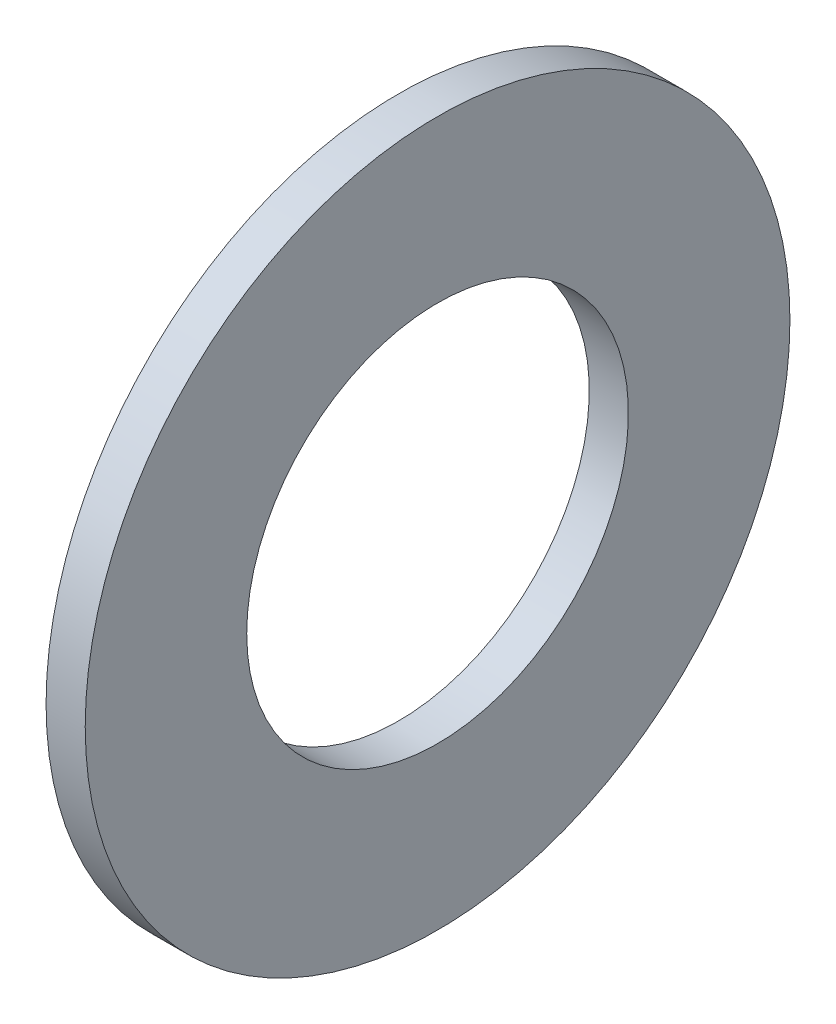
ISO-10303-21;
HEADER;
FILE_DESCRIPTION(('STEP AP214'),'2;1');
FILE_NAME('part.step','',(''),(''),'','','');
FILE_SCHEMA(('AUTOMOTIVE_DESIGN { 1 0 10303 214 1 1 1 1 }'));
ENDSEC;
DATA;
#1=APPLICATION_CONTEXT('core data for automotive mechanical design processes');
#2=APPLICATION_PROTOCOL_DEFINITION('international standard','automotive_design',2000,#1);
#3=PRODUCT_CONTEXT('',#1,'mechanical');
#4=PRODUCT('Part','Part','',(#3));
#5=PRODUCT_RELATED_PRODUCT_CATEGORY('part','',(#4));
#6=PRODUCT_DEFINITION_FORMATION('','',#4);
#7=PRODUCT_DEFINITION_CONTEXT('part definition',#1,'design');
#8=PRODUCT_DEFINITION('design','',#6,#7);
#9=PRODUCT_DEFINITION_SHAPE('','',#8);
#10=(LENGTH_UNIT() NAMED_UNIT(*) SI_UNIT(.MILLI.,.METRE.));
#11=(NAMED_UNIT(*) PLANE_ANGLE_UNIT() SI_UNIT($,.RADIAN.));
#12=(NAMED_UNIT(*) SI_UNIT($,.STERADIAN.) SOLID_ANGLE_UNIT());
#13=UNCERTAINTY_MEASURE_WITH_UNIT(LENGTH_MEASURE(1.E-05),#10,'distance_accuracy_value','');
#14=(GEOMETRIC_REPRESENTATION_CONTEXT(3) GLOBAL_UNCERTAINTY_ASSIGNED_CONTEXT((#13)) GLOBAL_UNIT_ASSIGNED_CONTEXT((#10,
#11,#12)) REPRESENTATION_CONTEXT('',''));
#15=CARTESIAN_POINT('',(0.,0.,0.));
#16=DIRECTION('',(0.,0.,1.));
#17=DIRECTION('',(1.,0.,0.));
#18=AXIS2_PLACEMENT_3D('',#15,#16,#17);
#19=CARTESIAN_POINT('',(-34.9249999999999,0.,0.));
#20=DIRECTION('',(-1.,0.,0.));
#21=DIRECTION('',(0.,0.,1.));
#22=AXIS2_PLACEMENT_3D('',#19,#20,#21);
#23=CYLINDRICAL_SURFACE('',#22,19.5);
#24=CARTESIAN_POINT('',(0.,0.,0.));
#25=DIRECTION('',(-1.,0.,0.));
#26=DIRECTION('',(0.,0.,1.));
#27=AXIS2_PLACEMENT_3D('',#24,#25,#26);
#28=CIRCLE('',#27,19.5);
#29=CARTESIAN_POINT('',(0.,0.,19.5));
#30=VERTEX_POINT('',#29);
#31=EDGE_CURVE('E10',#30,#30,#28,.T.);
#32=ORIENTED_EDGE('',*,*,#31,.F.);
#33=EDGE_LOOP('',(#32));
#34=FACE_BOUND('',#33,.T.);
#35=CARTESIAN_POINT('',(-4.,0.,0.));
#36=DIRECTION('',(-1.,0.,0.));
#37=DIRECTION('',(0.,0.,1.));
#38=AXIS2_PLACEMENT_3D('',#35,#36,#37);
#39=CIRCLE('',#38,19.5);
#40=CARTESIAN_POINT('',(-4.,0.,19.5));
#41=VERTEX_POINT('',#40);
#42=EDGE_CURVE('E45',#41,#41,#39,.T.);
#43=ORIENTED_EDGE('',*,*,#42,.T.);
#44=EDGE_LOOP('',(#43));
#45=FACE_BOUND('',#44,.T.);
#46=ADVANCED_FACE('F31',(#34,#45),#23,.F.);
#47=CARTESIAN_POINT('',(0.,19.5,0.));
#48=DIRECTION('',(-1.,0.,0.));
#49=DIRECTION('',(0.,0.,1.));
#50=AXIS2_PLACEMENT_3D('',#47,#48,#49);
#51=PLANE('',#50);
#52=CARTESIAN_POINT('',(0.,0.,0.));
#53=DIRECTION('',(-1.,0.,0.));
#54=DIRECTION('',(0.,0.,1.));
#55=AXIS2_PLACEMENT_3D('',#52,#53,#54);
#56=CIRCLE('',#55,36.);
#57=CARTESIAN_POINT('',(0.,0.,36.));
#58=VERTEX_POINT('',#57);
#59=EDGE_CURVE('E37',#58,#58,#56,.T.);
#60=ORIENTED_EDGE('',*,*,#59,.F.);
#61=EDGE_LOOP('',(#60));
#62=FACE_BOUND('',#61,.T.);
#63=ORIENTED_EDGE('',*,*,#31,.T.);
#64=EDGE_LOOP('',(#63));
#65=FACE_BOUND('',#64,.T.);
#66=ADVANCED_FACE('F60',(#62,#65),#51,.F.);
#67=CARTESIAN_POINT('',(-34.9249999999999,0.,0.));
#68=DIRECTION('',(-1.,0.,0.));
#69=DIRECTION('',(0.,0.,1.));
#70=AXIS2_PLACEMENT_3D('',#67,#68,#69);
#71=CYLINDRICAL_SURFACE('',#70,36.);
#72=CARTESIAN_POINT('',(-4.,0.,0.));
#73=DIRECTION('',(-1.,0.,0.));
#74=DIRECTION('',(0.,0.,1.));
#75=AXIS2_PLACEMENT_3D('',#72,#73,#74);
#76=CIRCLE('',#75,36.);
#77=CARTESIAN_POINT('',(-4.,0.,36.));
#78=VERTEX_POINT('',#77);
#79=EDGE_CURVE('E41',#78,#78,#76,.T.);
#80=ORIENTED_EDGE('',*,*,#79,.F.);
#81=EDGE_LOOP('',(#80));
#82=FACE_BOUND('',#81,.T.);
#83=ORIENTED_EDGE('',*,*,#59,.T.);
#84=EDGE_LOOP('',(#83));
#85=FACE_BOUND('',#84,.T.);
#86=ADVANCED_FACE('F55',(#82,#85),#71,.T.);
#87=CARTESIAN_POINT('',(-4.,36.,0.));
#88=DIRECTION('',(1.,0.,0.));
#89=DIRECTION('',(0.,0.,-1.));
#90=AXIS2_PLACEMENT_3D('',#87,#88,#89);
#91=PLANE('',#90);
#92=ORIENTED_EDGE('',*,*,#42,.F.);
#93=EDGE_LOOP('',(#92));
#94=FACE_BOUND('',#93,.T.);
#95=ORIENTED_EDGE('',*,*,#79,.T.);
#96=EDGE_LOOP('',(#95));
#97=FACE_BOUND('',#96,.T.);
#98=ADVANCED_FACE('F52',(#94,#97),#91,.F.);
#99=CLOSED_SHELL('',(#46,#66,#86,#98));
#100=MANIFOLD_SOLID_BREP('B2',#99);
#101=ADVANCED_BREP_SHAPE_REPRESENTATION('',(#18,#100),#14);
#102=SHAPE_DEFINITION_REPRESENTATION(#9,#101);
ENDSEC;
END-ISO-10303-21;
